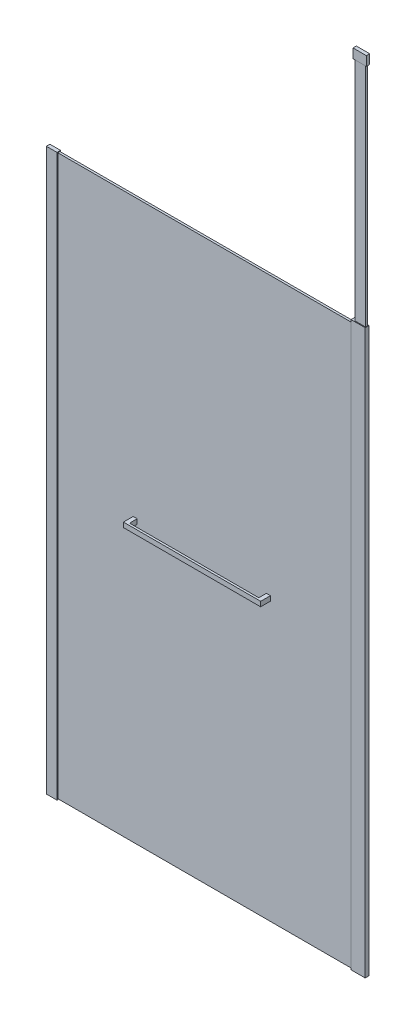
ISO-10303-21;
HEADER;
FILE_DESCRIPTION(('STEP AP214'),'2;1');
FILE_NAME('part.step','',(''),(''),'','','');
FILE_SCHEMA(('AUTOMOTIVE_DESIGN { 1 0 10303 214 1 1 1 1 }'));
ENDSEC;
DATA;
#1=APPLICATION_CONTEXT('core data for automotive mechanical design processes');
#2=APPLICATION_PROTOCOL_DEFINITION('international standard','automotive_design',2000,#1);
#3=PRODUCT_CONTEXT('',#1,'mechanical');
#4=PRODUCT('Part','Part','',(#3));
#5=PRODUCT_RELATED_PRODUCT_CATEGORY('part','',(#4));
#6=PRODUCT_DEFINITION_FORMATION('','',#4);
#7=PRODUCT_DEFINITION_CONTEXT('part definition',#1,'design');
#8=PRODUCT_DEFINITION('design','',#6,#7);
#9=PRODUCT_DEFINITION_SHAPE('','',#8);
#10=(LENGTH_UNIT() NAMED_UNIT(*) SI_UNIT(.MILLI.,.METRE.));
#11=(NAMED_UNIT(*) PLANE_ANGLE_UNIT() SI_UNIT($,.RADIAN.));
#12=(NAMED_UNIT(*) SI_UNIT($,.STERADIAN.) SOLID_ANGLE_UNIT());
#13=UNCERTAINTY_MEASURE_WITH_UNIT(LENGTH_MEASURE(1.E-05),#10,'distance_accuracy_value','');
#14=(GEOMETRIC_REPRESENTATION_CONTEXT(3) GLOBAL_UNCERTAINTY_ASSIGNED_CONTEXT((#13)) GLOBAL_UNIT_ASSIGNED_CONTEXT((#10,
#11,#12)) REPRESENTATION_CONTEXT('',''));
#15=CARTESIAN_POINT('',(0.,0.,0.));
#16=DIRECTION('',(0.,0.,1.));
#17=DIRECTION('',(1.,0.,0.));
#18=AXIS2_PLACEMENT_3D('',#15,#16,#17);
#19=CARTESIAN_POINT('',(337.5,1062.,-21.4));
#20=DIRECTION('',(1.,0.,0.));
#21=DIRECTION('',(0.,0.,-1.));
#22=AXIS2_PLACEMENT_3D('',#19,#20,#21);
#23=PLANE('',#22);
#24=DIRECTION('',(0.,1.,0.));
#25=VECTOR('',#24,1.);
#26=CARTESIAN_POINT('',(337.5,1062.,25.1));
#27=LINE('',#26,#25);
#28=CARTESIAN_POINT('',(337.5,1044.,25.1));
#29=VERTEX_POINT('',#28);
#30=CARTESIAN_POINT('',(337.5,1062.,25.1));
#31=VERTEX_POINT('',#30);
#32=EDGE_CURVE('E63',#29,#31,#27,.T.);
#33=ORIENTED_EDGE('',*,*,#32,.F.);
#34=DIRECTION('',(0.,0.,1.));
#35=VECTOR('',#34,1.);
#36=CARTESIAN_POINT('',(337.5,1044.,-21.4));
#37=LINE('',#36,#35);
#38=CARTESIAN_POINT('',(337.5,1044.,-21.4));
#39=VERTEX_POINT('',#38);
#40=EDGE_CURVE('E12',#39,#29,#37,.T.);
#41=ORIENTED_EDGE('',*,*,#40,.F.);
#42=DIRECTION('',(0.,1.,0.));
#43=VECTOR('',#42,1.);
#44=CARTESIAN_POINT('',(337.5,1062.,-21.4));
#45=LINE('',#44,#43);
#46=CARTESIAN_POINT('',(337.5,1062.,-21.4));
#47=VERTEX_POINT('',#46);
#48=EDGE_CURVE('E193',#39,#47,#45,.T.);
#49=ORIENTED_EDGE('',*,*,#48,.T.);
#50=DIRECTION('',(0.,0.,1.));
#51=VECTOR('',#50,1.);
#52=CARTESIAN_POINT('',(337.5,1062.,-21.4));
#53=LINE('',#52,#51);
#54=EDGE_CURVE('E176',#47,#31,#53,.T.);
#55=ORIENTED_EDGE('',*,*,#54,.T.);
#56=EDGE_LOOP('',(#33,#41,#49,#55));
#57=FACE_BOUND('',#56,.T.);
#58=ADVANCED_FACE('F46',(#57),#23,.T.);
#59=CARTESIAN_POINT('',(322.5,1044.,-21.4));
#60=DIRECTION('',(0.,-1.,0.));
#61=DIRECTION('',(0.,0.,-1.));
#62=AXIS2_PLACEMENT_3D('',#59,#60,#61);
#63=PLANE('',#62);
#64=ORIENTED_EDGE('',*,*,#40,.T.);
#65=DIRECTION('',(-1.,0.,0.));
#66=VECTOR('',#65,1.);
#67=CARTESIAN_POINT('',(842.197715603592,1044.,25.1));
#68=LINE('',#67,#66);
#69=CARTESIAN_POINT('',(822.5,1044.,25.1));
#70=VERTEX_POINT('',#69);
#71=EDGE_CURVE('E166',#70,#29,#68,.T.);
#72=ORIENTED_EDGE('',*,*,#71,.F.);
#73=DIRECTION('',(0.,0.,1.));
#74=VECTOR('',#73,1.);
#75=CARTESIAN_POINT('',(822.5,1044.,-21.4));
#76=LINE('',#75,#74);
#77=CARTESIAN_POINT('',(822.5,1044.,-21.4));
#78=VERTEX_POINT('',#77);
#79=EDGE_CURVE('E149',#78,#70,#76,.T.);
#80=ORIENTED_EDGE('',*,*,#79,.F.);
#81=DIRECTION('',(1.,0.,0.));
#82=VECTOR('',#81,1.);
#83=CARTESIAN_POINT('',(822.5,1044.,-21.4));
#84=LINE('',#83,#82);
#85=CARTESIAN_POINT('',(837.5,1044.,-21.4));
#86=VERTEX_POINT('',#85);
#87=EDGE_CURVE('E131',#78,#86,#84,.T.);
#88=ORIENTED_EDGE('',*,*,#87,.T.);
#89=DIRECTION('',(0.,0.,1.));
#90=VECTOR('',#89,1.);
#91=CARTESIAN_POINT('',(837.5,1044.,-21.4));
#92=LINE('',#91,#90);
#93=CARTESIAN_POINT('',(837.5,1044.,33.1));
#94=VERTEX_POINT('',#93);
#95=EDGE_CURVE('E147',#86,#94,#92,.T.);
#96=ORIENTED_EDGE('',*,*,#95,.T.);
#97=DIRECTION('',(1.,0.,0.));
#98=VECTOR('',#97,1.);
#99=CARTESIAN_POINT('',(322.5,1044.,33.1));
#100=LINE('',#99,#98);
#101=CARTESIAN_POINT('',(322.5,1044.,33.1));
#102=VERTEX_POINT('',#101);
#103=EDGE_CURVE('E135',#102,#94,#100,.T.);
#104=ORIENTED_EDGE('',*,*,#103,.F.);
#105=DIRECTION('',(0.,0.,1.));
#106=VECTOR('',#105,1.);
#107=CARTESIAN_POINT('',(322.5,1044.,-21.4));
#108=LINE('',#107,#106);
#109=CARTESIAN_POINT('',(322.5,1044.,-21.4));
#110=VERTEX_POINT('',#109);
#111=EDGE_CURVE('E55',#110,#102,#108,.T.);
#112=ORIENTED_EDGE('',*,*,#111,.F.);
#113=DIRECTION('',(1.,0.,0.));
#114=VECTOR('',#113,1.);
#115=CARTESIAN_POINT('',(322.5,1044.,-21.4));
#116=LINE('',#115,#114);
#117=EDGE_CURVE('E181',#110,#39,#116,.T.);
#118=ORIENTED_EDGE('',*,*,#117,.T.);
#119=EDGE_LOOP('',(#64,#72,#80,#88,#96,#104,#112,#118));
#120=FACE_BOUND('',#119,.T.);
#121=ADVANCED_FACE('F197',(#120),#63,.T.);
#122=CARTESIAN_POINT('',(322.5,1062.,-21.4));
#123=DIRECTION('',(-1.,0.,0.));
#124=DIRECTION('',(0.,0.,1.));
#125=AXIS2_PLACEMENT_3D('',#122,#123,#124);
#126=PLANE('',#125);
#127=ORIENTED_EDGE('',*,*,#111,.T.);
#128=DIRECTION('',(0.,-1.,0.));
#129=VECTOR('',#128,1.);
#130=CARTESIAN_POINT('',(322.5,1062.,33.1));
#131=LINE('',#130,#129);
#132=CARTESIAN_POINT('',(322.5,1062.,33.1));
#133=VERTEX_POINT('',#132);
#134=EDGE_CURVE('E121',#133,#102,#131,.T.);
#135=ORIENTED_EDGE('',*,*,#134,.F.);
#136=DIRECTION('',(0.,0.,1.));
#137=VECTOR('',#136,1.);
#138=CARTESIAN_POINT('',(322.5,1062.,-21.4));
#139=LINE('',#138,#137);
#140=CARTESIAN_POINT('',(322.5,1062.,-21.4));
#141=VERTEX_POINT('',#140);
#142=EDGE_CURVE('E116',#141,#133,#139,.T.);
#143=ORIENTED_EDGE('',*,*,#142,.F.);
#144=DIRECTION('',(0.,-1.,0.));
#145=VECTOR('',#144,1.);
#146=CARTESIAN_POINT('',(322.5,1062.,-21.4));
#147=LINE('',#146,#145);
#148=EDGE_CURVE('E186',#141,#110,#147,.T.);
#149=ORIENTED_EDGE('',*,*,#148,.T.);
#150=EDGE_LOOP('',(#127,#135,#143,#149));
#151=FACE_BOUND('',#150,.T.);
#152=ADVANCED_FACE('F218',(#151),#126,.T.);
#153=CARTESIAN_POINT('',(322.5,1062.,-21.4));
#154=DIRECTION('',(0.,1.,0.));
#155=DIRECTION('',(0.,0.,1.));
#156=AXIS2_PLACEMENT_3D('',#153,#154,#155);
#157=PLANE('',#156);
#158=ORIENTED_EDGE('',*,*,#142,.T.);
#159=DIRECTION('',(-1.,0.,0.));
#160=VECTOR('',#159,1.);
#161=CARTESIAN_POINT('',(322.5,1062.,33.1));
#162=LINE('',#161,#160);
#163=CARTESIAN_POINT('',(837.5,1062.,33.1));
#164=VERTEX_POINT('',#163);
#165=EDGE_CURVE('E109',#164,#133,#162,.T.);
#166=ORIENTED_EDGE('',*,*,#165,.F.);
#167=DIRECTION('',(0.,0.,1.));
#168=VECTOR('',#167,1.);
#169=CARTESIAN_POINT('',(837.5,1062.,-21.4));
#170=LINE('',#169,#168);
#171=CARTESIAN_POINT('',(837.5,1062.,-21.4));
#172=VERTEX_POINT('',#171);
#173=EDGE_CURVE('E113',#172,#164,#170,.T.);
#174=ORIENTED_EDGE('',*,*,#173,.F.);
#175=DIRECTION('',(-1.,0.,0.));
#176=VECTOR('',#175,1.);
#177=CARTESIAN_POINT('',(822.5,1062.,-21.4));
#178=LINE('',#177,#176);
#179=CARTESIAN_POINT('',(822.5,1062.,-21.4));
#180=VERTEX_POINT('',#179);
#181=EDGE_CURVE('E138',#172,#180,#178,.T.);
#182=ORIENTED_EDGE('',*,*,#181,.T.);
#183=DIRECTION('',(0.,0.,1.));
#184=VECTOR('',#183,1.);
#185=CARTESIAN_POINT('',(822.5,1062.,-21.4));
#186=LINE('',#185,#184);
#187=CARTESIAN_POINT('',(822.5,1062.,25.1));
#188=VERTEX_POINT('',#187);
#189=EDGE_CURVE('E130',#180,#188,#186,.T.);
#190=ORIENTED_EDGE('',*,*,#189,.T.);
#191=DIRECTION('',(-1.,0.,0.));
#192=VECTOR('',#191,1.);
#193=CARTESIAN_POINT('',(842.197715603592,1062.,25.1));
#194=LINE('',#193,#192);
#195=EDGE_CURVE('E163',#188,#31,#194,.T.);
#196=ORIENTED_EDGE('',*,*,#195,.T.);
#197=ORIENTED_EDGE('',*,*,#54,.F.);
#198=DIRECTION('',(-1.,0.,0.));
#199=VECTOR('',#198,1.);
#200=CARTESIAN_POINT('',(322.5,1062.,-21.4));
#201=LINE('',#200,#199);
#202=EDGE_CURVE('E190',#47,#141,#201,.T.);
#203=ORIENTED_EDGE('',*,*,#202,.T.);
#204=EDGE_LOOP('',(#158,#166,#174,#182,#190,#196,#197,#203));
#205=FACE_BOUND('',#204,.T.);
#206=ADVANCED_FACE('F111',(#205),#157,.T.);
#207=CARTESIAN_POINT('',(337.5,1044.,-21.4));
#208=DIRECTION('',(0.,0.,1.));
#209=DIRECTION('',(1.,0.,0.));
#210=AXIS2_PLACEMENT_3D('',#207,#208,#209);
#211=PLANE('',#210);
#212=ORIENTED_EDGE('',*,*,#48,.F.);
#213=ORIENTED_EDGE('',*,*,#117,.F.);
#214=ORIENTED_EDGE('',*,*,#148,.F.);
#215=ORIENTED_EDGE('',*,*,#202,.F.);
#216=EDGE_LOOP('',(#212,#213,#214,#215));
#217=FACE_BOUND('',#216,.T.);
#218=ADVANCED_FACE('F225',(#217),#211,.F.);
#219=CARTESIAN_POINT('',(337.5,1044.,33.1));
#220=DIRECTION('',(0.,0.,1.));
#221=DIRECTION('',(1.,0.,0.));
#222=AXIS2_PLACEMENT_3D('',#219,#220,#221);
#223=PLANE('',#222);
#224=ORIENTED_EDGE('',*,*,#103,.T.);
#225=DIRECTION('',(0.,1.,0.));
#226=VECTOR('',#225,1.);
#227=CARTESIAN_POINT('',(837.5,1062.,33.1));
#228=LINE('',#227,#226);
#229=EDGE_CURVE('E127',#94,#164,#228,.T.);
#230=ORIENTED_EDGE('',*,*,#229,.T.);
#231=ORIENTED_EDGE('',*,*,#165,.T.);
#232=ORIENTED_EDGE('',*,*,#134,.T.);
#233=EDGE_LOOP('',(#224,#230,#231,#232));
#234=FACE_BOUND('',#233,.T.);
#235=ADVANCED_FACE('F133',(#234),#223,.T.);
#236=CARTESIAN_POINT('',(842.197715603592,1062.,25.1));
#237=DIRECTION('',(0.,0.,1.));
#238=DIRECTION('',(1.,0.,0.));
#239=AXIS2_PLACEMENT_3D('',#236,#237,#238);
#240=PLANE('',#239);
#241=ORIENTED_EDGE('',*,*,#195,.F.);
#242=DIRECTION('',(0.,-1.,0.));
#243=VECTOR('',#242,1.);
#244=CARTESIAN_POINT('',(822.5,1062.,25.1));
#245=LINE('',#244,#243);
#246=EDGE_CURVE('E49',#188,#70,#245,.T.);
#247=ORIENTED_EDGE('',*,*,#246,.T.);
#248=ORIENTED_EDGE('',*,*,#71,.T.);
#249=ORIENTED_EDGE('',*,*,#32,.T.);
#250=EDGE_LOOP('',(#241,#247,#248,#249));
#251=FACE_BOUND('',#250,.T.);
#252=ADVANCED_FACE('F203',(#251),#240,.F.);
#253=CARTESIAN_POINT('',(822.5,1062.,-21.4));
#254=DIRECTION('',(-1.,0.,0.));
#255=DIRECTION('',(0.,0.,1.));
#256=AXIS2_PLACEMENT_3D('',#253,#254,#255);
#257=PLANE('',#256);
#258=ORIENTED_EDGE('',*,*,#246,.F.);
#259=ORIENTED_EDGE('',*,*,#189,.F.);
#260=DIRECTION('',(0.,-1.,0.));
#261=VECTOR('',#260,1.);
#262=CARTESIAN_POINT('',(822.5,1062.,-21.4));
#263=LINE('',#262,#261);
#264=EDGE_CURVE('E142',#180,#78,#263,.T.);
#265=ORIENTED_EDGE('',*,*,#264,.T.);
#266=ORIENTED_EDGE('',*,*,#79,.T.);
#267=EDGE_LOOP('',(#258,#259,#265,#266));
#268=FACE_BOUND('',#267,.T.);
#269=ADVANCED_FACE('F204',(#268),#257,.T.);
#270=CARTESIAN_POINT('',(837.5,1062.,-21.4));
#271=DIRECTION('',(1.,0.,0.));
#272=DIRECTION('',(0.,0.,-1.));
#273=AXIS2_PLACEMENT_3D('',#270,#271,#272);
#274=PLANE('',#273);
#275=ORIENTED_EDGE('',*,*,#173,.T.);
#276=ORIENTED_EDGE('',*,*,#229,.F.);
#277=ORIENTED_EDGE('',*,*,#95,.F.);
#278=DIRECTION('',(0.,1.,0.));
#279=VECTOR('',#278,1.);
#280=CARTESIAN_POINT('',(837.5,1062.,-21.4));
#281=LINE('',#280,#279);
#282=EDGE_CURVE('E129',#86,#172,#281,.T.);
#283=ORIENTED_EDGE('',*,*,#282,.T.);
#284=EDGE_LOOP('',(#275,#276,#277,#283));
#285=FACE_BOUND('',#284,.T.);
#286=ADVANCED_FACE('F126',(#285),#274,.T.);
#287=CARTESIAN_POINT('',(837.5,1044.,-21.4));
#288=DIRECTION('',(0.,0.,1.));
#289=DIRECTION('',(1.,0.,0.));
#290=AXIS2_PLACEMENT_3D('',#287,#288,#289);
#291=PLANE('',#290);
#292=ORIENTED_EDGE('',*,*,#282,.F.);
#293=ORIENTED_EDGE('',*,*,#87,.F.);
#294=ORIENTED_EDGE('',*,*,#264,.F.);
#295=ORIENTED_EDGE('',*,*,#181,.F.);
#296=EDGE_LOOP('',(#292,#293,#294,#295));
#297=FACE_BOUND('',#296,.T.);
#298=ADVANCED_FACE('F200',(#297),#291,.F.);
#299=CLOSED_SHELL('',(#58,#121,#152,#206,#218,#235,#252,#269,#286,#298));
#300=MANIFOLD_SOLID_BREP('B2',#299);
#301=CARTESIAN_POINT('',(1149.9,3000.,-1.1500000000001));
#302=DIRECTION('',(1.,0.,0.));
#303=DIRECTION('',(0.,1.,0.));
#304=AXIS2_PLACEMENT_3D('',#301,#302,#303);
#305=PLANE('',#304);
#306=DIRECTION('',(0.,0.,1.));
#307=VECTOR('',#306,1.);
#308=CARTESIAN_POINT('',(1149.9,2965.,-1.1500000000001));
#309=LINE('',#308,#307);
#310=CARTESIAN_POINT('',(1149.9,2965.,-13.6500000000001));
#311=VERTEX_POINT('',#310);
#312=CARTESIAN_POINT('',(1149.9,2965.,-1.1500000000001));
#313=VERTEX_POINT('',#312);
#314=EDGE_CURVE('E406',#311,#313,#309,.T.);
#315=ORIENTED_EDGE('',*,*,#314,.T.);
#316=DIRECTION('',(0.,-1.,0.));
#317=VECTOR('',#316,1.);
#318=CARTESIAN_POINT('',(1149.9,3000.,-1.1500000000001));
#319=LINE('',#318,#317);
#320=CARTESIAN_POINT('',(1149.9,3000.,-1.1500000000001));
#321=VERTEX_POINT('',#320);
#322=EDGE_CURVE('E387',#321,#313,#319,.T.);
#323=ORIENTED_EDGE('',*,*,#322,.F.);
#324=DIRECTION('',(0.,0.,1.));
#325=VECTOR('',#324,1.);
#326=CARTESIAN_POINT('',(1149.9,3000.,-1.1500000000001));
#327=LINE('',#326,#325);
#328=CARTESIAN_POINT('',(1149.9,3000.,-13.6500000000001));
#329=VERTEX_POINT('',#328);
#330=EDGE_CURVE('E394',#329,#321,#327,.T.);
#331=ORIENTED_EDGE('',*,*,#330,.F.);
#332=DIRECTION('',(0.,-1.,0.));
#333=VECTOR('',#332,1.);
#334=CARTESIAN_POINT('',(1149.9,3000.,-13.6500000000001));
#335=LINE('',#334,#333);
#336=EDGE_CURVE('E545',#329,#311,#335,.T.);
#337=ORIENTED_EDGE('',*,*,#336,.T.);
#338=EDGE_LOOP('',(#315,#323,#331,#337));
#339=FACE_BOUND('',#338,.T.);
#340=ADVANCED_FACE('F318',(#339),#305,.F.);
#341=CARTESIAN_POINT('',(1199.9,3000.,-1.1500000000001));
#342=DIRECTION('',(0.,0.,-1.));
#343=DIRECTION('',(-1.,0.,0.));
#344=AXIS2_PLACEMENT_3D('',#341,#342,#343);
#345=PLANE('',#344);
#346=DIRECTION('',(1.,0.,0.));
#347=VECTOR('',#346,1.);
#348=CARTESIAN_POINT('',(1199.9,2965.,-1.1500000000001));
#349=LINE('',#348,#347);
#350=CARTESIAN_POINT('',(1199.9,2965.,-1.1500000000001));
#351=VERTEX_POINT('',#350);
#352=EDGE_CURVE('E543',#313,#351,#349,.T.);
#353=ORIENTED_EDGE('',*,*,#352,.T.);
#354=DIRECTION('',(0.,-1.,0.));
#355=VECTOR('',#354,1.);
#356=CARTESIAN_POINT('',(1199.9,3000.,-1.1500000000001));
#357=LINE('',#356,#355);
#358=CARTESIAN_POINT('',(1199.9,3000.,-1.1500000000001));
#359=VERTEX_POINT('',#358);
#360=EDGE_CURVE('E390',#359,#351,#357,.T.);
#361=ORIENTED_EDGE('',*,*,#360,.F.);
#362=DIRECTION('',(1.,0.,0.));
#363=VECTOR('',#362,1.);
#364=CARTESIAN_POINT('',(1199.9,3000.,-1.1500000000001));
#365=LINE('',#364,#363);
#366=EDGE_CURVE('E383',#321,#359,#365,.T.);
#367=ORIENTED_EDGE('',*,*,#366,.F.);
#368=ORIENTED_EDGE('',*,*,#322,.T.);
#369=EDGE_LOOP('',(#353,#361,#367,#368));
#370=FACE_BOUND('',#369,.T.);
#371=ADVANCED_FACE('F385',(#370),#345,.F.);
#372=CARTESIAN_POINT('',(1199.9,3000.,-1.1500000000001));
#373=DIRECTION('',(-1.,0.,0.));
#374=DIRECTION('',(0.,-1.,0.));
#375=AXIS2_PLACEMENT_3D('',#372,#373,#374);
#376=PLANE('',#375);
#377=DIRECTION('',(0.,0.,-1.));
#378=VECTOR('',#377,1.);
#379=CARTESIAN_POINT('',(1199.9,2965.,-1.1500000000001));
#380=LINE('',#379,#378);
#381=CARTESIAN_POINT('',(1199.9,2965.,-13.6500000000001));
#382=VERTEX_POINT('',#381);
#383=EDGE_CURVE('E539',#351,#382,#380,.T.);
#384=ORIENTED_EDGE('',*,*,#383,.T.);
#385=DIRECTION('',(0.,-1.,0.));
#386=VECTOR('',#385,1.);
#387=CARTESIAN_POINT('',(1199.9,3000.,-13.6500000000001));
#388=LINE('',#387,#386);
#389=CARTESIAN_POINT('',(1199.9,3000.,-13.6500000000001));
#390=VERTEX_POINT('',#389);
#391=EDGE_CURVE('E410',#390,#382,#388,.T.);
#392=ORIENTED_EDGE('',*,*,#391,.F.);
#393=DIRECTION('',(0.,0.,-1.));
#394=VECTOR('',#393,1.);
#395=CARTESIAN_POINT('',(1199.9,3000.,-1.1500000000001));
#396=LINE('',#395,#394);
#397=EDGE_CURVE('E393',#359,#390,#396,.T.);
#398=ORIENTED_EDGE('',*,*,#397,.F.);
#399=ORIENTED_EDGE('',*,*,#360,.T.);
#400=EDGE_LOOP('',(#384,#392,#398,#399));
#401=FACE_BOUND('',#400,.T.);
#402=ADVANCED_FACE('F460',(#401),#376,.F.);
#403=CARTESIAN_POINT('',(1199.9,3000.,-13.6500000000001));
#404=DIRECTION('',(0.,0.,1.));
#405=DIRECTION('',(1.,0.,0.));
#406=AXIS2_PLACEMENT_3D('',#403,#404,#405);
#407=PLANE('',#406);
#408=DIRECTION('',(-1.,0.,0.));
#409=VECTOR('',#408,1.);
#410=CARTESIAN_POINT('',(1199.9,2965.,-13.6500000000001));
#411=LINE('',#410,#409);
#412=EDGE_CURVE('E403',#382,#311,#411,.T.);
#413=ORIENTED_EDGE('',*,*,#412,.T.);
#414=ORIENTED_EDGE('',*,*,#336,.F.);
#415=DIRECTION('',(-1.,0.,0.));
#416=VECTOR('',#415,1.);
#417=CARTESIAN_POINT('',(1199.9,3000.,-13.6500000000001));
#418=LINE('',#417,#416);
#419=EDGE_CURVE('E399',#390,#329,#418,.T.);
#420=ORIENTED_EDGE('',*,*,#419,.F.);
#421=ORIENTED_EDGE('',*,*,#391,.T.);
#422=EDGE_LOOP('',(#413,#414,#420,#421));
#423=FACE_BOUND('',#422,.T.);
#424=ADVANCED_FACE('F507',(#423),#407,.F.);
#425=CARTESIAN_POINT('',(1149.9,3000.,-13.6500000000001));
#426=DIRECTION('',(0.,1.,0.));
#427=DIRECTION('',(0.,0.,1.));
#428=AXIS2_PLACEMENT_3D('',#425,#426,#427);
#429=PLANE('',#428);
#430=ORIENTED_EDGE('',*,*,#330,.T.);
#431=ORIENTED_EDGE('',*,*,#366,.T.);
#432=ORIENTED_EDGE('',*,*,#397,.T.);
#433=ORIENTED_EDGE('',*,*,#419,.T.);
#434=EDGE_LOOP('',(#430,#431,#432,#433));
#435=FACE_BOUND('',#434,.T.);
#436=ADVANCED_FACE('F397',(#435),#429,.T.);
#437=CARTESIAN_POINT('',(1149.9,2965.,-13.6500000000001));
#438=DIRECTION('',(0.,1.,0.));
#439=DIRECTION('',(0.,0.,1.));
#440=AXIS2_PLACEMENT_3D('',#437,#438,#439);
#441=PLANE('',#440);
#442=DIRECTION('',(0.,0.,1.));
#443=VECTOR('',#442,1.);
#444=CARTESIAN_POINT('',(1194.9,2965.,-11.4000000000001));
#445=LINE('',#444,#443);
#446=CARTESIAN_POINT('',(1194.9,2965.,-11.4000000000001));
#447=VERTEX_POINT('',#446);
#448=CARTESIAN_POINT('',(1194.9,2965.,-3.40000000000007));
#449=VERTEX_POINT('',#448);
#450=EDGE_CURVE('E415',#447,#449,#445,.T.);
#451=ORIENTED_EDGE('',*,*,#450,.F.);
#452=DIRECTION('',(1.,0.,0.));
#453=VECTOR('',#452,1.);
#454=CARTESIAN_POINT('',(1194.9,2965.,-11.4000000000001));
#455=LINE('',#454,#453);
#456=CARTESIAN_POINT('',(1154.9,2965.,-11.4000000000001));
#457=VERTEX_POINT('',#456);
#458=EDGE_CURVE('E408',#457,#447,#455,.T.);
#459=ORIENTED_EDGE('',*,*,#458,.F.);
#460=DIRECTION('',(0.,0.,-1.));
#461=VECTOR('',#460,1.);
#462=CARTESIAN_POINT('',(1154.9,2965.,-11.4000000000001));
#463=LINE('',#462,#461);
#464=CARTESIAN_POINT('',(1154.9,2965.,-3.40000000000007));
#465=VERTEX_POINT('',#464);
#466=EDGE_CURVE('E333',#465,#457,#463,.T.);
#467=ORIENTED_EDGE('',*,*,#466,.F.);
#468=DIRECTION('',(-1.,0.,0.));
#469=VECTOR('',#468,1.);
#470=CARTESIAN_POINT('',(1194.9,2965.,-3.40000000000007));
#471=LINE('',#470,#469);
#472=EDGE_CURVE('E44',#449,#465,#471,.T.);
#473=ORIENTED_EDGE('',*,*,#472,.F.);
#474=EDGE_LOOP('',(#451,#459,#467,#473));
#475=FACE_BOUND('',#474,.T.);
#476=ORIENTED_EDGE('',*,*,#314,.F.);
#477=ORIENTED_EDGE('',*,*,#412,.F.);
#478=ORIENTED_EDGE('',*,*,#383,.F.);
#479=ORIENTED_EDGE('',*,*,#352,.F.);
#480=EDGE_LOOP('',(#476,#477,#478,#479));
#481=FACE_BOUND('',#480,.T.);
#482=ADVANCED_FACE('F490',(#475,#481),#441,.F.);
#483=CARTESIAN_POINT('',(1194.9,2997.,-11.4000000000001));
#484=DIRECTION('',(1.,0.,0.));
#485=DIRECTION('',(0.,0.,-1.));
#486=AXIS2_PLACEMENT_3D('',#483,#484,#485);
#487=PLANE('',#486);
#488=DIRECTION('',(0.,-1.,0.));
#489=VECTOR('',#488,1.);
#490=CARTESIAN_POINT('',(1194.9,2997.,-11.4000000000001));
#491=LINE('',#490,#489);
#492=CARTESIAN_POINT('',(1194.9,2114.,-11.4000000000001));
#493=VERTEX_POINT('',#492);
#494=EDGE_CURVE('E326',#447,#493,#491,.T.);
#495=ORIENTED_EDGE('',*,*,#494,.F.);
#496=ORIENTED_EDGE('',*,*,#450,.T.);
#497=DIRECTION('',(0.,-1.,0.));
#498=VECTOR('',#497,1.);
#499=CARTESIAN_POINT('',(1194.9,2997.,-3.40000000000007));
#500=LINE('',#499,#498);
#501=CARTESIAN_POINT('',(1194.9,2114.,-3.40000000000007));
#502=VERTEX_POINT('',#501);
#503=EDGE_CURVE('E430',#449,#502,#500,.T.);
#504=ORIENTED_EDGE('',*,*,#503,.T.);
#505=DIRECTION('',(0.,0.,1.));
#506=VECTOR('',#505,1.);
#507=CARTESIAN_POINT('',(1194.9,2114.,-11.4000000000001));
#508=LINE('',#507,#506);
#509=EDGE_CURVE('E418',#493,#502,#508,.T.);
#510=ORIENTED_EDGE('',*,*,#509,.F.);
#511=EDGE_LOOP('',(#495,#496,#504,#510));
#512=FACE_BOUND('',#511,.T.);
#513=ADVANCED_FACE('F320',(#512),#487,.T.);
#514=CARTESIAN_POINT('',(1194.9,2997.,-11.4000000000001));
#515=DIRECTION('',(0.,0.,-1.));
#516=DIRECTION('',(-1.,0.,0.));
#517=AXIS2_PLACEMENT_3D('',#514,#515,#516);
#518=PLANE('',#517);
#519=DIRECTION('',(0.,-1.,0.));
#520=VECTOR('',#519,1.);
#521=CARTESIAN_POINT('',(1154.9,2997.,-11.4000000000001));
#522=LINE('',#521,#520);
#523=CARTESIAN_POINT('',(1154.9,2114.,-11.4000000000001));
#524=VERTEX_POINT('',#523);
#525=EDGE_CURVE('E432',#457,#524,#522,.T.);
#526=ORIENTED_EDGE('',*,*,#525,.F.);
#527=ORIENTED_EDGE('',*,*,#458,.T.);
#528=ORIENTED_EDGE('',*,*,#494,.T.);
#529=DIRECTION('',(1.,0.,0.));
#530=VECTOR('',#529,1.);
#531=CARTESIAN_POINT('',(1194.9,2114.,-11.4000000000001));
#532=LINE('',#531,#530);
#533=EDGE_CURVE('E427',#524,#493,#532,.T.);
#534=ORIENTED_EDGE('',*,*,#533,.F.);
#535=EDGE_LOOP('',(#526,#527,#528,#534));
#536=FACE_BOUND('',#535,.T.);
#537=ADVANCED_FACE('F445',(#536),#518,.T.);
#538=CARTESIAN_POINT('',(1154.9,2997.,-11.4000000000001));
#539=DIRECTION('',(-1.,0.,0.));
#540=DIRECTION('',(0.,0.,1.));
#541=AXIS2_PLACEMENT_3D('',#538,#539,#540);
#542=PLANE('',#541);
#543=DIRECTION('',(0.,-1.,0.));
#544=VECTOR('',#543,1.);
#545=CARTESIAN_POINT('',(1154.9,2997.,-3.40000000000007));
#546=LINE('',#545,#544);
#547=CARTESIAN_POINT('',(1154.9,2114.,-3.40000000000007));
#548=VERTEX_POINT('',#547);
#549=EDGE_CURVE('E434',#465,#548,#546,.T.);
#550=ORIENTED_EDGE('',*,*,#549,.F.);
#551=ORIENTED_EDGE('',*,*,#466,.T.);
#552=ORIENTED_EDGE('',*,*,#525,.T.);
#553=DIRECTION('',(0.,0.,-1.));
#554=VECTOR('',#553,1.);
#555=CARTESIAN_POINT('',(1154.9,2114.,-11.4000000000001));
#556=LINE('',#555,#554);
#557=EDGE_CURVE('E424',#548,#524,#556,.T.);
#558=ORIENTED_EDGE('',*,*,#557,.F.);
#559=EDGE_LOOP('',(#550,#551,#552,#558));
#560=FACE_BOUND('',#559,.T.);
#561=ADVANCED_FACE('F447',(#560),#542,.T.);
#562=CARTESIAN_POINT('',(1194.9,2997.,-3.40000000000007));
#563=DIRECTION('',(0.,0.,1.));
#564=DIRECTION('',(1.,0.,0.));
#565=AXIS2_PLACEMENT_3D('',#562,#563,#564);
#566=PLANE('',#565);
#567=ORIENTED_EDGE('',*,*,#503,.F.);
#568=ORIENTED_EDGE('',*,*,#472,.T.);
#569=ORIENTED_EDGE('',*,*,#549,.T.);
#570=DIRECTION('',(-1.,0.,0.));
#571=VECTOR('',#570,1.);
#572=CARTESIAN_POINT('',(1194.9,2114.,-3.40000000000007));
#573=LINE('',#572,#571);
#574=EDGE_CURVE('E421',#502,#548,#573,.T.);
#575=ORIENTED_EDGE('',*,*,#574,.F.);
#576=EDGE_LOOP('',(#567,#568,#569,#575));
#577=FACE_BOUND('',#576,.T.);
#578=ADVANCED_FACE('F439',(#577),#566,.T.);
#579=CARTESIAN_POINT('',(1194.9,2114.,-3.40000000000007));
#580=DIRECTION('',(0.,-1.,0.));
#581=DIRECTION('',(0.,0.,-1.));
#582=AXIS2_PLACEMENT_3D('',#579,#580,#581);
#583=PLANE('',#582);
#584=ORIENTED_EDGE('',*,*,#509,.T.);
#585=ORIENTED_EDGE('',*,*,#574,.T.);
#586=ORIENTED_EDGE('',*,*,#557,.T.);
#587=ORIENTED_EDGE('',*,*,#533,.T.);
#588=EDGE_LOOP('',(#584,#585,#586,#587));
#589=FACE_BOUND('',#588,.T.);
#590=ADVANCED_FACE('F443',(#589),#583,.T.);
#591=CLOSED_SHELL('',(#340,#371,#402,#424,#436,#482,#513,#537,#561,#578,#590));
#592=MANIFOLD_SOLID_BREP('B6',#591);
#593=CARTESIAN_POINT('',(1153.5,2111.,-3.39999999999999));
#594=DIRECTION('',(0.,0.,-1.));
#595=DIRECTION('',(-1.,0.,0.));
#596=AXIS2_PLACEMENT_3D('',#593,#594,#595);
#597=PLANE('',#596);
#598=DIRECTION('',(-1.,0.,0.));
#599=VECTOR('',#598,1.);
#600=CARTESIAN_POINT('',(1153.5,2103.2,-3.39999999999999));
#601=LINE('',#600,#599);
#602=CARTESIAN_POINT('',(1153.5,2103.2,-3.39999999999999));
#603=VERTEX_POINT('',#602);
#604=CARTESIAN_POINT('',(1143.4,2103.2,-3.39999999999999));
#605=VERTEX_POINT('',#604);
#606=EDGE_CURVE('E672',#603,#605,#601,.T.);
#607=ORIENTED_EDGE('',*,*,#606,.F.);
#608=DIRECTION('',(0.,-1.,0.));
#609=VECTOR('',#608,1.);
#610=CARTESIAN_POINT('',(1153.5,2111.,-3.39999999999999));
#611=LINE('',#610,#609);
#612=CARTESIAN_POINT('',(1153.5,3.,-3.39999999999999));
#613=VERTEX_POINT('',#612);
#614=EDGE_CURVE('E695',#603,#613,#611,.T.);
#615=ORIENTED_EDGE('',*,*,#614,.T.);
#616=DIRECTION('',(1.,0.,0.));
#617=VECTOR('',#616,1.);
#618=CARTESIAN_POINT('',(1153.5,3.,-3.39999999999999));
#619=LINE('',#618,#617);
#620=CARTESIAN_POINT('',(1143.4,3.,-3.39999999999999));
#621=VERTEX_POINT('',#620);
#622=EDGE_CURVE('E683',#621,#613,#619,.T.);
#623=ORIENTED_EDGE('',*,*,#622,.F.);
#624=DIRECTION('',(0.,-1.,0.));
#625=VECTOR('',#624,1.);
#626=CARTESIAN_POINT('',(1143.4,2111.,-3.39999999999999));
#627=LINE('',#626,#625);
#628=EDGE_CURVE('E575',#605,#621,#627,.T.);
#629=ORIENTED_EDGE('',*,*,#628,.F.);
#630=EDGE_LOOP('',(#607,#615,#623,#629));
#631=FACE_BOUND('',#630,.T.);
#632=ADVANCED_FACE('F567',(#631),#597,.T.);
#633=CARTESIAN_POINT('',(1143.4,2111.,-3.39999999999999));
#634=DIRECTION('',(-1.,0.,0.));
#635=DIRECTION('',(0.,0.,1.));
#636=AXIS2_PLACEMENT_3D('',#633,#634,#635);
#637=PLANE('',#636);
#638=DIRECTION('',(0.,-1.,0.));
#639=VECTOR('',#638,1.);
#640=CARTESIAN_POINT('',(1143.4,2111.,-14.4));
#641=LINE('',#640,#639);
#642=CARTESIAN_POINT('',(1143.4,2114.,-14.4));
#643=VERTEX_POINT('',#642);
#644=CARTESIAN_POINT('',(1143.4,0.,-14.4));
#645=VERTEX_POINT('',#644);
#646=EDGE_CURVE('E635',#643,#645,#641,.T.);
#647=ORIENTED_EDGE('',*,*,#646,.T.);
#648=DIRECTION('',(0.,0.,-1.));
#649=VECTOR('',#648,1.);
#650=CARTESIAN_POINT('',(1143.4,0.,-0.399999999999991));
#651=LINE('',#650,#649);
#652=CARTESIAN_POINT('',(1143.4,0.,-0.399999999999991));
#653=VERTEX_POINT('',#652);
#654=EDGE_CURVE('E639',#653,#645,#651,.T.);
#655=ORIENTED_EDGE('',*,*,#654,.F.);
#656=DIRECTION('',(0.,-1.,0.));
#657=VECTOR('',#656,1.);
#658=CARTESIAN_POINT('',(1143.4,2111.,-0.399999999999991));
#659=LINE('',#658,#657);
#660=CARTESIAN_POINT('',(1143.4,2114.,-0.399999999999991));
#661=VERTEX_POINT('',#660);
#662=EDGE_CURVE('E690',#661,#653,#659,.T.);
#663=ORIENTED_EDGE('',*,*,#662,.F.);
#664=DIRECTION('',(0.,0.,1.));
#665=VECTOR('',#664,1.);
#666=CARTESIAN_POINT('',(1143.4,2114.,-14.4));
#667=LINE('',#666,#665);
#668=EDGE_CURVE('E641',#643,#661,#667,.T.);
#669=ORIENTED_EDGE('',*,*,#668,.F.);
#670=EDGE_LOOP('',(#647,#655,#663,#669));
#671=FACE_BOUND('',#670,.T.);
#672=DIRECTION('',(0.,0.,1.));
#673=VECTOR('',#672,1.);
#674=CARTESIAN_POINT('',(1143.4,2103.2,-3.34999999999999));
#675=LINE('',#674,#673);
#676=CARTESIAN_POINT('',(1143.4,2103.2,-11.4));
#677=VERTEX_POINT('',#676);
#678=EDGE_CURVE('E666',#677,#605,#675,.T.);
#679=ORIENTED_EDGE('',*,*,#678,.T.);
#680=ORIENTED_EDGE('',*,*,#628,.T.);
#681=DIRECTION('',(0.,0.,-1.));
#682=VECTOR('',#681,1.);
#683=CARTESIAN_POINT('',(1143.4,3.,-0.399999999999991));
#684=LINE('',#683,#682);
#685=CARTESIAN_POINT('',(1143.4,3.,-11.4));
#686=VERTEX_POINT('',#685);
#687=EDGE_CURVE('E660',#621,#686,#684,.T.);
#688=ORIENTED_EDGE('',*,*,#687,.T.);
#689=DIRECTION('',(0.,-1.,0.));
#690=VECTOR('',#689,1.);
#691=CARTESIAN_POINT('',(1143.4,2111.,-11.4));
#692=LINE('',#691,#690);
#693=EDGE_CURVE('E646',#677,#686,#692,.T.);
#694=ORIENTED_EDGE('',*,*,#693,.F.);
#695=EDGE_LOOP('',(#679,#680,#688,#694));
#696=FACE_BOUND('',#695,.T.);
#697=ADVANCED_FACE('F637',(#671,#696),#637,.T.);
#698=CARTESIAN_POINT('',(1143.4,2111.,-0.399999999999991));
#699=DIRECTION('',(0.,0.,1.));
#700=DIRECTION('',(1.,0.,0.));
#701=AXIS2_PLACEMENT_3D('',#698,#699,#700);
#702=PLANE('',#701);
#703=ORIENTED_EDGE('',*,*,#662,.T.);
#704=DIRECTION('',(-1.,0.,0.));
#705=VECTOR('',#704,1.);
#706=CARTESIAN_POINT('',(1143.4,0.,-0.399999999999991));
#707=LINE('',#706,#705);
#708=CARTESIAN_POINT('',(1196.4,0.,-0.399999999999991));
#709=VERTEX_POINT('',#708);
#710=EDGE_CURVE('E659',#709,#653,#707,.T.);
#711=ORIENTED_EDGE('',*,*,#710,.F.);
#712=DIRECTION('',(0.,-1.,0.));
#713=VECTOR('',#712,1.);
#714=CARTESIAN_POINT('',(1196.4,2111.,-0.399999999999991));
#715=LINE('',#714,#713);
#716=CARTESIAN_POINT('',(1196.4,2114.,-0.399999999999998));
#717=VERTEX_POINT('',#716);
#718=EDGE_CURVE('E782',#717,#709,#715,.T.);
#719=ORIENTED_EDGE('',*,*,#718,.F.);
#720=DIRECTION('',(1.,0.,0.));
#721=VECTOR('',#720,1.);
#722=CARTESIAN_POINT('',(1196.4,2114.,-0.399999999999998));
#723=LINE('',#722,#721);
#724=EDGE_CURVE('E680',#661,#717,#723,.T.);
#725=ORIENTED_EDGE('',*,*,#724,.F.);
#726=EDGE_LOOP('',(#703,#711,#719,#725));
#727=FACE_BOUND('',#726,.T.);
#728=ADVANCED_FACE('F723',(#727),#702,.T.);
#729=CARTESIAN_POINT('',(1196.4,2111.,-0.399999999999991));
#730=DIRECTION('',(1.,0.,0.));
#731=DIRECTION('',(0.,0.,-1.));
#732=AXIS2_PLACEMENT_3D('',#729,#730,#731);
#733=PLANE('',#732);
#734=ORIENTED_EDGE('',*,*,#718,.T.);
#735=DIRECTION('',(0.,0.,1.));
#736=VECTOR('',#735,1.);
#737=CARTESIAN_POINT('',(1196.4,0.,-0.399999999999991));
#738=LINE('',#737,#736);
#739=CARTESIAN_POINT('',(1196.4,0.,-14.4));
#740=VERTEX_POINT('',#739);
#741=EDGE_CURVE('E654',#740,#709,#738,.T.);
#742=ORIENTED_EDGE('',*,*,#741,.F.);
#743=DIRECTION('',(0.,-1.,0.));
#744=VECTOR('',#743,1.);
#745=CARTESIAN_POINT('',(1196.4,2111.,-14.4));
#746=LINE('',#745,#744);
#747=CARTESIAN_POINT('',(1196.4,2114.,-14.4));
#748=VERTEX_POINT('',#747);
#749=EDGE_CURVE('E645',#748,#740,#746,.T.);
#750=ORIENTED_EDGE('',*,*,#749,.F.);
#751=DIRECTION('',(0.,0.,-1.));
#752=VECTOR('',#751,1.);
#753=CARTESIAN_POINT('',(1196.4,2114.,-14.4));
#754=LINE('',#753,#752);
#755=EDGE_CURVE('E674',#717,#748,#754,.T.);
#756=ORIENTED_EDGE('',*,*,#755,.F.);
#757=EDGE_LOOP('',(#734,#742,#750,#756));
#758=FACE_BOUND('',#757,.T.);
#759=ADVANCED_FACE('F728',(#758),#733,.T.);
#760=CARTESIAN_POINT('',(1196.4,2111.,-14.4));
#761=DIRECTION('',(0.,0.,-1.));
#762=DIRECTION('',(-1.,0.,0.));
#763=AXIS2_PLACEMENT_3D('',#760,#761,#762);
#764=PLANE('',#763);
#765=ORIENTED_EDGE('',*,*,#749,.T.);
#766=DIRECTION('',(1.,0.,0.));
#767=VECTOR('',#766,1.);
#768=CARTESIAN_POINT('',(1143.4,0.,-14.4));
#769=LINE('',#768,#767);
#770=EDGE_CURVE('E649',#645,#740,#769,.T.);
#771=ORIENTED_EDGE('',*,*,#770,.F.);
#772=ORIENTED_EDGE('',*,*,#646,.F.);
#773=DIRECTION('',(-1.,0.,0.));
#774=VECTOR('',#773,1.);
#775=CARTESIAN_POINT('',(1196.4,2114.,-14.4));
#776=LINE('',#775,#774);
#777=EDGE_CURVE('E677',#748,#643,#776,.T.);
#778=ORIENTED_EDGE('',*,*,#777,.F.);
#779=EDGE_LOOP('',(#765,#771,#772,#778));
#780=FACE_BOUND('',#779,.T.);
#781=ADVANCED_FACE('F650',(#780),#764,.T.);
#782=CARTESIAN_POINT('',(1143.4,2111.,-11.4));
#783=DIRECTION('',(0.,0.,1.));
#784=DIRECTION('',(1.,0.,0.));
#785=AXIS2_PLACEMENT_3D('',#782,#783,#784);
#786=PLANE('',#785);
#787=DIRECTION('',(1.,0.,0.));
#788=VECTOR('',#787,1.);
#789=CARTESIAN_POINT('',(1143.4,2103.2,-11.4));
#790=LINE('',#789,#788);
#791=CARTESIAN_POINT('',(1153.5,2103.2,-11.4));
#792=VERTEX_POINT('',#791);
#793=EDGE_CURVE('E670',#677,#792,#790,.T.);
#794=ORIENTED_EDGE('',*,*,#793,.F.);
#795=ORIENTED_EDGE('',*,*,#693,.T.);
#796=DIRECTION('',(-1.,0.,0.));
#797=VECTOR('',#796,1.);
#798=CARTESIAN_POINT('',(1143.4,3.,-11.4));
#799=LINE('',#798,#797);
#800=CARTESIAN_POINT('',(1153.5,3.,-11.4));
#801=VERTEX_POINT('',#800);
#802=EDGE_CURVE('E687',#801,#686,#799,.T.);
#803=ORIENTED_EDGE('',*,*,#802,.F.);
#804=DIRECTION('',(0.,-1.,0.));
#805=VECTOR('',#804,1.);
#806=CARTESIAN_POINT('',(1153.5,2111.,-11.4));
#807=LINE('',#806,#805);
#808=EDGE_CURVE('E590',#792,#801,#807,.T.);
#809=ORIENTED_EDGE('',*,*,#808,.F.);
#810=EDGE_LOOP('',(#794,#795,#803,#809));
#811=FACE_BOUND('',#810,.T.);
#812=ADVANCED_FACE('F709',(#811),#786,.T.);
#813=CARTESIAN_POINT('',(1153.5,2111.,-11.4));
#814=DIRECTION('',(-1.,0.,0.));
#815=DIRECTION('',(0.,0.,1.));
#816=AXIS2_PLACEMENT_3D('',#813,#814,#815);
#817=PLANE('',#816);
#818=DIRECTION('',(0.,0.,1.));
#819=VECTOR('',#818,1.);
#820=CARTESIAN_POINT('',(1153.5,2103.2,-11.4));
#821=LINE('',#820,#819);
#822=EDGE_CURVE('E316',#792,#603,#821,.T.);
#823=ORIENTED_EDGE('',*,*,#822,.F.);
#824=ORIENTED_EDGE('',*,*,#808,.T.);
#825=DIRECTION('',(0.,0.,-1.));
#826=VECTOR('',#825,1.);
#827=CARTESIAN_POINT('',(1153.5,3.,-11.4));
#828=LINE('',#827,#826);
#829=EDGE_CURVE('E684',#613,#801,#828,.T.);
#830=ORIENTED_EDGE('',*,*,#829,.F.);
#831=ORIENTED_EDGE('',*,*,#614,.F.);
#832=EDGE_LOOP('',(#823,#824,#830,#831));
#833=FACE_BOUND('',#832,.T.);
#834=ADVANCED_FACE('F706',(#833),#817,.T.);
#835=CARTESIAN_POINT('',(1196.4,2114.,-0.399999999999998));
#836=DIRECTION('',(0.,-1.,0.));
#837=DIRECTION('',(0.,0.,-1.));
#838=AXIS2_PLACEMENT_3D('',#835,#836,#837);
#839=PLANE('',#838);
#840=ORIENTED_EDGE('',*,*,#755,.T.);
#841=ORIENTED_EDGE('',*,*,#777,.T.);
#842=ORIENTED_EDGE('',*,*,#668,.T.);
#843=ORIENTED_EDGE('',*,*,#724,.T.);
#844=EDGE_LOOP('',(#840,#841,#842,#843));
#845=FACE_BOUND('',#844,.T.);
#846=ADVANCED_FACE('F708',(#845),#839,.F.);
#847=CARTESIAN_POINT('',(1158.4,2103.2,-3.34999999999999));
#848=DIRECTION('',(0.,-1.,0.));
#849=DIRECTION('',(0.,0.,-1.));
#850=AXIS2_PLACEMENT_3D('',#847,#848,#849);
#851=PLANE('',#850);
#852=ORIENTED_EDGE('',*,*,#822,.T.);
#853=ORIENTED_EDGE('',*,*,#606,.T.);
#854=ORIENTED_EDGE('',*,*,#678,.F.);
#855=ORIENTED_EDGE('',*,*,#793,.T.);
#856=EDGE_LOOP('',(#852,#853,#854,#855));
#857=FACE_BOUND('',#856,.T.);
#858=ADVANCED_FACE('F714',(#857),#851,.T.);
#859=CARTESIAN_POINT('',(1143.4,3.,-14.4));
#860=DIRECTION('',(0.,-1.,0.));
#861=DIRECTION('',(0.,0.,-1.));
#862=AXIS2_PLACEMENT_3D('',#859,#860,#861);
#863=PLANE('',#862);
#864=ORIENTED_EDGE('',*,*,#687,.F.);
#865=ORIENTED_EDGE('',*,*,#622,.T.);
#866=ORIENTED_EDGE('',*,*,#829,.T.);
#867=ORIENTED_EDGE('',*,*,#802,.T.);
#868=EDGE_LOOP('',(#864,#865,#866,#867));
#869=FACE_BOUND('',#868,.T.);
#870=ADVANCED_FACE('F701',(#869),#863,.F.);
#871=CARTESIAN_POINT('',(1143.4,0.,-14.4));
#872=DIRECTION('',(0.,-1.,0.));
#873=DIRECTION('',(0.,0.,-1.));
#874=AXIS2_PLACEMENT_3D('',#871,#872,#873);
#875=PLANE('',#874);
#876=ORIENTED_EDGE('',*,*,#654,.T.);
#877=ORIENTED_EDGE('',*,*,#770,.T.);
#878=ORIENTED_EDGE('',*,*,#741,.T.);
#879=ORIENTED_EDGE('',*,*,#710,.T.);
#880=EDGE_LOOP('',(#876,#877,#878,#879));
#881=FACE_BOUND('',#880,.T.);
#882=ADVANCED_FACE('F657',(#881),#875,.T.);
#883=CLOSED_SHELL('',(#632,#697,#728,#759,#781,#812,#834,#846,#858,#870,#882));
#884=MANIFOLD_SOLID_BREP('B38',#883);
#885=CARTESIAN_POINT('',(6.5,2103.,-3.39999999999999));
#886=DIRECTION('',(-1.,0.,0.));
#887=DIRECTION('',(0.,0.,1.));
#888=AXIS2_PLACEMENT_3D('',#885,#886,#887);
#889=PLANE('',#888);
#890=DIRECTION('',(0.,0.,-1.));
#891=VECTOR('',#890,1.);
#892=CARTESIAN_POINT('',(6.5,3.,-3.39999999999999));
#893=LINE('',#892,#891);
#894=CARTESIAN_POINT('',(6.5,3.,-3.39999999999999));
#895=VERTEX_POINT('',#894);
#896=CARTESIAN_POINT('',(6.5,3.,-11.4));
#897=VERTEX_POINT('',#896);
#898=EDGE_CURVE('E919',#895,#897,#893,.T.);
#899=ORIENTED_EDGE('',*,*,#898,.F.);
#900=DIRECTION('',(0.,-1.,0.));
#901=VECTOR('',#900,1.);
#902=CARTESIAN_POINT('',(6.5,2103.,-3.39999999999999));
#903=LINE('',#902,#901);
#904=CARTESIAN_POINT('',(6.5,2103.,-3.39999999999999));
#905=VERTEX_POINT('',#904);
#906=EDGE_CURVE('E565',#905,#895,#903,.T.);
#907=ORIENTED_EDGE('',*,*,#906,.F.);
#908=DIRECTION('',(0.,0.,-1.));
#909=VECTOR('',#908,1.);
#910=CARTESIAN_POINT('',(6.5,2103.,-3.39999999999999));
#911=LINE('',#910,#909);
#912=CARTESIAN_POINT('',(6.5,2103.,-11.4));
#913=VERTEX_POINT('',#912);
#914=EDGE_CURVE('E913',#905,#913,#911,.T.);
#915=ORIENTED_EDGE('',*,*,#914,.T.);
#916=DIRECTION('',(0.,-1.,0.));
#917=VECTOR('',#916,1.);
#918=CARTESIAN_POINT('',(6.5,2103.,-11.4));
#919=LINE('',#918,#917);
#920=EDGE_CURVE('E858',#913,#897,#919,.T.);
#921=ORIENTED_EDGE('',*,*,#920,.T.);
#922=EDGE_LOOP('',(#899,#907,#915,#921));
#923=FACE_BOUND('',#922,.T.);
#924=ADVANCED_FACE('F855',(#923),#889,.T.);
#925=CARTESIAN_POINT('',(6.5,2103.,-3.39999999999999));
#926=DIRECTION('',(0.,0.,1.));
#927=DIRECTION('',(1.,0.,0.));
#928=AXIS2_PLACEMENT_3D('',#925,#926,#927);
#929=PLANE('',#928);
#930=DIRECTION('',(-1.,0.,0.));
#931=VECTOR('',#930,1.);
#932=CARTESIAN_POINT('',(6.5,3.,-3.39999999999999));
#933=LINE('',#932,#931);
#934=CARTESIAN_POINT('',(1153.5,3.,-3.39999999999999));
#935=VERTEX_POINT('',#934);
#936=EDGE_CURVE('E915',#935,#895,#933,.T.);
#937=ORIENTED_EDGE('',*,*,#936,.F.);
#938=DIRECTION('',(0.,-1.,0.));
#939=VECTOR('',#938,1.);
#940=CARTESIAN_POINT('',(1153.5,2103.,-3.39999999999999));
#941=LINE('',#940,#939);
#942=CARTESIAN_POINT('',(1153.5,2103.,-3.39999999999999));
#943=VERTEX_POINT('',#942);
#944=EDGE_CURVE('E864',#943,#935,#941,.T.);
#945=ORIENTED_EDGE('',*,*,#944,.F.);
#946=DIRECTION('',(-1.,0.,0.));
#947=VECTOR('',#946,1.);
#948=CARTESIAN_POINT('',(6.5,2103.,-3.39999999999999));
#949=LINE('',#948,#947);
#950=EDGE_CURVE('E910',#943,#905,#949,.T.);
#951=ORIENTED_EDGE('',*,*,#950,.T.);
#952=ORIENTED_EDGE('',*,*,#906,.T.);
#953=EDGE_LOOP('',(#937,#945,#951,#952));
#954=FACE_BOUND('',#953,.T.);
#955=ADVANCED_FACE('F929',(#954),#929,.T.);
#956=CARTESIAN_POINT('',(1153.5,2103.,-3.39999999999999));
#957=DIRECTION('',(1.,0.,0.));
#958=DIRECTION('',(0.,0.,-1.));
#959=AXIS2_PLACEMENT_3D('',#956,#957,#958);
#960=PLANE('',#959);
#961=DIRECTION('',(0.,0.,1.));
#962=VECTOR('',#961,1.);
#963=CARTESIAN_POINT('',(1153.5,3.,-3.39999999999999));
#964=LINE('',#963,#962);
#965=CARTESIAN_POINT('',(1153.5,3.,-11.4));
#966=VERTEX_POINT('',#965);
#967=EDGE_CURVE('E905',#966,#935,#964,.T.);
#968=ORIENTED_EDGE('',*,*,#967,.F.);
#969=DIRECTION('',(0.,-1.,0.));
#970=VECTOR('',#969,1.);
#971=CARTESIAN_POINT('',(1153.5,2103.,-11.4));
#972=LINE('',#971,#970);
#973=CARTESIAN_POINT('',(1153.5,2103.,-11.4));
#974=VERTEX_POINT('',#973);
#975=EDGE_CURVE('E900',#974,#966,#972,.T.);
#976=ORIENTED_EDGE('',*,*,#975,.F.);
#977=DIRECTION('',(0.,0.,1.));
#978=VECTOR('',#977,1.);
#979=CARTESIAN_POINT('',(1153.5,2103.,-3.39999999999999));
#980=LINE('',#979,#978);
#981=EDGE_CURVE('E903',#974,#943,#980,.T.);
#982=ORIENTED_EDGE('',*,*,#981,.T.);
#983=ORIENTED_EDGE('',*,*,#944,.T.);
#984=EDGE_LOOP('',(#968,#976,#982,#983));
#985=FACE_BOUND('',#984,.T.);
#986=ADVANCED_FACE('F902',(#985),#960,.T.);
#987=CARTESIAN_POINT('',(6.5,2103.,-11.4));
#988=DIRECTION('',(0.,0.,-1.));
#989=DIRECTION('',(-1.,0.,0.));
#990=AXIS2_PLACEMENT_3D('',#987,#988,#989);
#991=PLANE('',#990);
#992=DIRECTION('',(1.,0.,0.));
#993=VECTOR('',#992,1.);
#994=CARTESIAN_POINT('',(6.5,3.,-11.4));
#995=LINE('',#994,#993);
#996=EDGE_CURVE('E922',#897,#966,#995,.T.);
#997=ORIENTED_EDGE('',*,*,#996,.F.);
#998=ORIENTED_EDGE('',*,*,#920,.F.);
#999=DIRECTION('',(1.,0.,0.));
#1000=VECTOR('',#999,1.);
#1001=CARTESIAN_POINT('',(6.5,2103.,-11.4));
#1002=LINE('',#1001,#1000);
#1003=EDGE_CURVE('E909',#913,#974,#1002,.T.);
#1004=ORIENTED_EDGE('',*,*,#1003,.T.);
#1005=ORIENTED_EDGE('',*,*,#975,.T.);
#1006=EDGE_LOOP('',(#997,#998,#1004,#1005));
#1007=FACE_BOUND('',#1006,.T.);
#1008=ADVANCED_FACE('F912',(#1007),#991,.T.);
#1009=CARTESIAN_POINT('',(6.5,2103.,-11.4));
#1010=DIRECTION('',(0.,-1.,0.));
#1011=DIRECTION('',(0.,0.,-1.));
#1012=AXIS2_PLACEMENT_3D('',#1009,#1010,#1011);
#1013=PLANE('',#1012);
#1014=ORIENTED_EDGE('',*,*,#914,.F.);
#1015=ORIENTED_EDGE('',*,*,#950,.F.);
#1016=ORIENTED_EDGE('',*,*,#981,.F.);
#1017=ORIENTED_EDGE('',*,*,#1003,.F.);
#1018=EDGE_LOOP('',(#1014,#1015,#1016,#1017));
#1019=FACE_BOUND('',#1018,.T.);
#1020=ADVANCED_FACE('F908',(#1019),#1013,.F.);
#1021=CARTESIAN_POINT('',(6.5,3.,-11.4));
#1022=DIRECTION('',(0.,-1.,0.));
#1023=DIRECTION('',(0.,0.,-1.));
#1024=AXIS2_PLACEMENT_3D('',#1021,#1022,#1023);
#1025=PLANE('',#1024);
#1026=ORIENTED_EDGE('',*,*,#898,.T.);
#1027=ORIENTED_EDGE('',*,*,#996,.T.);
#1028=ORIENTED_EDGE('',*,*,#967,.T.);
#1029=ORIENTED_EDGE('',*,*,#936,.T.);
#1030=EDGE_LOOP('',(#1026,#1027,#1028,#1029));
#1031=FACE_BOUND('',#1030,.T.);
#1032=ADVANCED_FACE('F928',(#1031),#1025,.T.);
#1033=CLOSED_SHELL('',(#924,#955,#986,#1008,#1020,#1032));
#1034=MANIFOLD_SOLID_BREP('B310',#1033);
#1035=CARTESIAN_POINT('',(40.,2103.,0.));
#1036=DIRECTION('',(0.,0.,-1.));
#1037=DIRECTION('',(-1.,0.,0.));
#1038=AXIS2_PLACEMENT_3D('',#1035,#1036,#1037);
#1039=PLANE('',#1038);
#1040=DIRECTION('',(0.,-1.,0.));
#1041=VECTOR('',#1040,1.);
#1042=CARTESIAN_POINT('',(0.,2103.,0.));
#1043=LINE('',#1042,#1041);
#1044=CARTESIAN_POINT('',(0.,2106.,0.));
#1045=VERTEX_POINT('',#1044);
#1046=CARTESIAN_POINT('',(0.,0.,0.));
#1047=VERTEX_POINT('',#1046);
#1048=EDGE_CURVE('E1053',#1045,#1047,#1043,.T.);
#1049=ORIENTED_EDGE('',*,*,#1048,.T.);
#1050=DIRECTION('',(-1.,0.,0.));
#1051=VECTOR('',#1050,1.);
#1052=CARTESIAN_POINT('',(0.,0.,0.));
#1053=LINE('',#1052,#1051);
#1054=CARTESIAN_POINT('',(40.,0.,0.));
#1055=VERTEX_POINT('',#1054);
#1056=EDGE_CURVE('E1066',#1055,#1047,#1053,.T.);
#1057=ORIENTED_EDGE('',*,*,#1056,.F.);
#1058=DIRECTION('',(0.,-1.,0.));
#1059=VECTOR('',#1058,1.);
#1060=CARTESIAN_POINT('',(40.,2103.,0.));
#1061=LINE('',#1060,#1059);
#1062=CARTESIAN_POINT('',(40.,2106.,0.));
#1063=VERTEX_POINT('',#1062);
#1064=EDGE_CURVE('E853',#1063,#1055,#1061,.T.);
#1065=ORIENTED_EDGE('',*,*,#1064,.F.);
#1066=DIRECTION('',(1.,0.,0.));
#1067=VECTOR('',#1066,1.);
#1068=CARTESIAN_POINT('',(0.,2106.,0.));
#1069=LINE('',#1068,#1067);
#1070=EDGE_CURVE('E1078',#1045,#1063,#1069,.T.);
#1071=ORIENTED_EDGE('',*,*,#1070,.F.);
#1072=EDGE_LOOP('',(#1049,#1057,#1065,#1071));
#1073=FACE_BOUND('',#1072,.T.);
#1074=ADVANCED_FACE('F979',(#1073),#1039,.F.);
#1075=CARTESIAN_POINT('',(6.5,2103.,-3.39999999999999));
#1076=DIRECTION('',(0.,0.,1.));
#1077=DIRECTION('',(1.,0.,0.));
#1078=AXIS2_PLACEMENT_3D('',#1075,#1076,#1077);
#1079=PLANE('',#1078);
#1080=DIRECTION('',(-1.,0.,0.));
#1081=VECTOR('',#1080,1.);
#1082=CARTESIAN_POINT('',(6.5,3.,-3.39999999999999));
#1083=LINE('',#1082,#1081);
#1084=CARTESIAN_POINT('',(40.,3.,-3.39999999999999));
#1085=VERTEX_POINT('',#1084);
#1086=CARTESIAN_POINT('',(6.5,3.,-3.39999999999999));
#1087=VERTEX_POINT('',#1086);
#1088=EDGE_CURVE('E1086',#1085,#1087,#1083,.T.);
#1089=ORIENTED_EDGE('',*,*,#1088,.T.);
#1090=DIRECTION('',(0.,-1.,0.));
#1091=VECTOR('',#1090,1.);
#1092=CARTESIAN_POINT('',(6.5,2103.,-3.39999999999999));
#1093=LINE('',#1092,#1091);
#1094=CARTESIAN_POINT('',(6.5,2103.,-3.39999999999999));
#1095=VERTEX_POINT('',#1094);
#1096=EDGE_CURVE('E1107',#1095,#1087,#1093,.T.);
#1097=ORIENTED_EDGE('',*,*,#1096,.F.);
#1098=DIRECTION('',(-1.,0.,0.));
#1099=VECTOR('',#1098,1.);
#1100=CARTESIAN_POINT('',(6.5,2103.,-3.39999999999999));
#1101=LINE('',#1100,#1099);
#1102=CARTESIAN_POINT('',(40.,2103.,-3.39999999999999));
#1103=VERTEX_POINT('',#1102);
#1104=EDGE_CURVE('E1095',#1103,#1095,#1101,.T.);
#1105=ORIENTED_EDGE('',*,*,#1104,.F.);
#1106=DIRECTION('',(0.,-1.,0.));
#1107=VECTOR('',#1106,1.);
#1108=CARTESIAN_POINT('',(40.,2103.,-3.39999999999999));
#1109=LINE('',#1108,#1107);
#1110=EDGE_CURVE('E989',#1103,#1085,#1109,.T.);
#1111=ORIENTED_EDGE('',*,*,#1110,.T.);
#1112=EDGE_LOOP('',(#1089,#1097,#1105,#1111));
#1113=FACE_BOUND('',#1112,.T.);
#1114=ADVANCED_FACE('F1149',(#1113),#1079,.F.);
#1115=CARTESIAN_POINT('',(6.5,2103.,-11.4));
#1116=DIRECTION('',(-1.,0.,0.));
#1117=DIRECTION('',(0.,0.,1.));
#1118=AXIS2_PLACEMENT_3D('',#1115,#1116,#1117);
#1119=PLANE('',#1118);
#1120=DIRECTION('',(0.,0.,-1.));
#1121=VECTOR('',#1120,1.);
#1122=CARTESIAN_POINT('',(6.5,3.,-11.4));
#1123=LINE('',#1122,#1121);
#1124=CARTESIAN_POINT('',(6.5,3.,-11.4));
#1125=VERTEX_POINT('',#1124);
#1126=EDGE_CURVE('E1098',#1087,#1125,#1123,.T.);
#1127=ORIENTED_EDGE('',*,*,#1126,.T.);
#1128=DIRECTION('',(0.,-1.,0.));
#1129=VECTOR('',#1128,1.);
#1130=CARTESIAN_POINT('',(6.5,2103.,-11.4));
#1131=LINE('',#1130,#1129);
#1132=CARTESIAN_POINT('',(6.5,2103.,-11.4));
#1133=VERTEX_POINT('',#1132);
#1134=EDGE_CURVE('E997',#1133,#1125,#1131,.T.);
#1135=ORIENTED_EDGE('',*,*,#1134,.F.);
#1136=DIRECTION('',(0.,0.,-1.));
#1137=VECTOR('',#1136,1.);
#1138=CARTESIAN_POINT('',(6.5,2103.,-11.4));
#1139=LINE('',#1138,#1137);
#1140=EDGE_CURVE('E1091',#1095,#1133,#1139,.T.);
#1141=ORIENTED_EDGE('',*,*,#1140,.F.);
#1142=ORIENTED_EDGE('',*,*,#1096,.T.);
#1143=EDGE_LOOP('',(#1127,#1135,#1141,#1142));
#1144=FACE_BOUND('',#1143,.T.);
#1145=ADVANCED_FACE('F1146',(#1144),#1119,.F.);
#1146=CARTESIAN_POINT('',(40.,2103.,-11.4));
#1147=DIRECTION('',(0.,0.,-1.));
#1148=DIRECTION('',(-1.,0.,0.));
#1149=AXIS2_PLACEMENT_3D('',#1146,#1147,#1148);
#1150=PLANE('',#1149);
#1151=DIRECTION('',(1.,0.,0.));
#1152=VECTOR('',#1151,1.);
#1153=CARTESIAN_POINT('',(40.,3.,-11.4));
#1154=LINE('',#1153,#1152);
#1155=CARTESIAN_POINT('',(40.,3.,-11.4));
#1156=VERTEX_POINT('',#1155);
#1157=EDGE_CURVE('E982',#1125,#1156,#1154,.T.);
#1158=ORIENTED_EDGE('',*,*,#1157,.T.);
#1159=DIRECTION('',(0.,-1.,0.));
#1160=VECTOR('',#1159,1.);
#1161=CARTESIAN_POINT('',(40.,2103.,-11.4));
#1162=LINE('',#1161,#1160);
#1163=CARTESIAN_POINT('',(40.,2103.,-11.4));
#1164=VERTEX_POINT('',#1163);
#1165=EDGE_CURVE('E1123',#1164,#1156,#1162,.T.);
#1166=ORIENTED_EDGE('',*,*,#1165,.F.);
#1167=DIRECTION('',(1.,0.,0.));
#1168=VECTOR('',#1167,1.);
#1169=CARTESIAN_POINT('',(40.,2103.,-11.4));
#1170=LINE('',#1169,#1168);
#1171=EDGE_CURVE('E1094',#1133,#1164,#1170,.T.);
#1172=ORIENTED_EDGE('',*,*,#1171,.F.);
#1173=ORIENTED_EDGE('',*,*,#1134,.T.);
#1174=EDGE_LOOP('',(#1158,#1166,#1172,#1173));
#1175=FACE_BOUND('',#1174,.T.);
#1176=ADVANCED_FACE('F1122',(#1175),#1150,.F.);
#1177=CARTESIAN_POINT('',(40.,2103.,-13.3));
#1178=DIRECTION('',(-1.,0.,0.));
#1179=DIRECTION('',(0.,0.,1.));
#1180=AXIS2_PLACEMENT_3D('',#1177,#1178,#1179);
#1181=PLANE('',#1180);
#1182=DIRECTION('',(0.,0.,1.));
#1183=VECTOR('',#1182,1.);
#1184=CARTESIAN_POINT('',(40.,0.,0.));
#1185=LINE('',#1184,#1183);
#1186=CARTESIAN_POINT('',(40.,0.,-13.3));
#1187=VERTEX_POINT('',#1186);
#1188=EDGE_CURVE('E1061',#1187,#1055,#1185,.T.);
#1189=ORIENTED_EDGE('',*,*,#1188,.F.);
#1190=DIRECTION('',(0.,-1.,0.));
#1191=VECTOR('',#1190,1.);
#1192=CARTESIAN_POINT('',(40.,2103.,-13.3));
#1193=LINE('',#1192,#1191);
#1194=CARTESIAN_POINT('',(40.,2106.,-13.3));
#1195=VERTEX_POINT('',#1194);
#1196=EDGE_CURVE('E1052',#1195,#1187,#1193,.T.);
#1197=ORIENTED_EDGE('',*,*,#1196,.F.);
#1198=DIRECTION('',(0.,0.,-1.));
#1199=VECTOR('',#1198,1.);
#1200=CARTESIAN_POINT('',(40.,2106.,-13.3));
#1201=LINE('',#1200,#1199);
#1202=EDGE_CURVE('E1081',#1063,#1195,#1201,.T.);
#1203=ORIENTED_EDGE('',*,*,#1202,.F.);
#1204=ORIENTED_EDGE('',*,*,#1064,.T.);
#1205=EDGE_LOOP('',(#1189,#1197,#1203,#1204));
#1206=FACE_BOUND('',#1205,.T.);
#1207=ORIENTED_EDGE('',*,*,#1165,.T.);
#1208=DIRECTION('',(0.,0.,1.));
#1209=VECTOR('',#1208,1.);
#1210=CARTESIAN_POINT('',(40.,3.,0.));
#1211=LINE('',#1210,#1209);
#1212=EDGE_CURVE('E1067',#1156,#1085,#1211,.T.);
#1213=ORIENTED_EDGE('',*,*,#1212,.T.);
#1214=ORIENTED_EDGE('',*,*,#1110,.F.);
#1215=DIRECTION('',(0.,0.,-1.));
#1216=VECTOR('',#1215,1.);
#1217=CARTESIAN_POINT('',(40.,2103.,-13.3));
#1218=LINE('',#1217,#1216);
#1219=EDGE_CURVE('E1074',#1103,#1164,#1218,.T.);
#1220=ORIENTED_EDGE('',*,*,#1219,.T.);
#1221=EDGE_LOOP('',(#1207,#1213,#1214,#1220));
#1222=FACE_BOUND('',#1221,.T.);
#1223=ADVANCED_FACE('F1126',(#1206,#1222),#1181,.F.);
#1224=CARTESIAN_POINT('',(0.,2103.,-13.3));
#1225=DIRECTION('',(0.,0.,1.));
#1226=DIRECTION('',(1.,0.,0.));
#1227=AXIS2_PLACEMENT_3D('',#1224,#1225,#1226);
#1228=PLANE('',#1227);
#1229=ORIENTED_EDGE('',*,*,#1196,.T.);
#1230=DIRECTION('',(1.,0.,0.));
#1231=VECTOR('',#1230,1.);
#1232=CARTESIAN_POINT('',(0.,0.,-13.3));
#1233=LINE('',#1232,#1231);
#1234=CARTESIAN_POINT('',(0.,0.,-13.3));
#1235=VERTEX_POINT('',#1234);
#1236=EDGE_CURVE('E1056',#1235,#1187,#1233,.T.);
#1237=ORIENTED_EDGE('',*,*,#1236,.F.);
#1238=DIRECTION('',(0.,-1.,0.));
#1239=VECTOR('',#1238,1.);
#1240=CARTESIAN_POINT('',(0.,2103.,-13.3));
#1241=LINE('',#1240,#1239);
#1242=CARTESIAN_POINT('',(0.,2106.,-13.3));
#1243=VERTEX_POINT('',#1242);
#1244=EDGE_CURVE('E1042',#1243,#1235,#1241,.T.);
#1245=ORIENTED_EDGE('',*,*,#1244,.F.);
#1246=DIRECTION('',(-1.,0.,0.));
#1247=VECTOR('',#1246,1.);
#1248=CARTESIAN_POINT('',(0.,2106.,-13.3));
#1249=LINE('',#1248,#1247);
#1250=EDGE_CURVE('E1084',#1195,#1243,#1249,.T.);
#1251=ORIENTED_EDGE('',*,*,#1250,.F.);
#1252=EDGE_LOOP('',(#1229,#1237,#1245,#1251));
#1253=FACE_BOUND('',#1252,.T.);
#1254=ADVANCED_FACE('F1057',(#1253),#1228,.F.);
#1255=CARTESIAN_POINT('',(0.,2103.,0.));
#1256=DIRECTION('',(1.,0.,0.));
#1257=DIRECTION('',(0.,0.,-1.));
#1258=AXIS2_PLACEMENT_3D('',#1255,#1256,#1257);
#1259=PLANE('',#1258);
#1260=ORIENTED_EDGE('',*,*,#1244,.T.);
#1261=DIRECTION('',(0.,0.,-1.));
#1262=VECTOR('',#1261,1.);
#1263=CARTESIAN_POINT('',(0.,0.,0.));
#1264=LINE('',#1263,#1262);
#1265=EDGE_CURVE('E1046',#1047,#1235,#1264,.T.);
#1266=ORIENTED_EDGE('',*,*,#1265,.F.);
#1267=ORIENTED_EDGE('',*,*,#1048,.F.);
#1268=DIRECTION('',(0.,0.,1.));
#1269=VECTOR('',#1268,1.);
#1270=CARTESIAN_POINT('',(0.,2106.,-13.3));
#1271=LINE('',#1270,#1269);
#1272=EDGE_CURVE('E1048',#1243,#1045,#1271,.T.);
#1273=ORIENTED_EDGE('',*,*,#1272,.F.);
#1274=EDGE_LOOP('',(#1260,#1266,#1267,#1273));
#1275=FACE_BOUND('',#1274,.T.);
#1276=ADVANCED_FACE('F1044',(#1275),#1259,.F.);
#1277=CARTESIAN_POINT('',(0.,2103.,0.));
#1278=DIRECTION('',(0.,1.,0.));
#1279=DIRECTION('',(0.,0.,1.));
#1280=AXIS2_PLACEMENT_3D('',#1277,#1278,#1279);
#1281=PLANE('',#1280);
#1282=ORIENTED_EDGE('',*,*,#1219,.F.);
#1283=ORIENTED_EDGE('',*,*,#1104,.T.);
#1284=ORIENTED_EDGE('',*,*,#1140,.T.);
#1285=ORIENTED_EDGE('',*,*,#1171,.T.);
#1286=EDGE_LOOP('',(#1282,#1283,#1284,#1285));
#1287=FACE_BOUND('',#1286,.T.);
#1288=ADVANCED_FACE('F1186',(#1287),#1281,.F.);
#1289=CARTESIAN_POINT('',(0.,2106.,0.));
#1290=DIRECTION('',(0.,1.,0.));
#1291=DIRECTION('',(0.,0.,1.));
#1292=AXIS2_PLACEMENT_3D('',#1289,#1290,#1291);
#1293=PLANE('',#1292);
#1294=ORIENTED_EDGE('',*,*,#1272,.T.);
#1295=ORIENTED_EDGE('',*,*,#1070,.T.);
#1296=ORIENTED_EDGE('',*,*,#1202,.T.);
#1297=ORIENTED_EDGE('',*,*,#1250,.T.);
#1298=EDGE_LOOP('',(#1294,#1295,#1296,#1297));
#1299=FACE_BOUND('',#1298,.T.);
#1300=ADVANCED_FACE('F1137',(#1299),#1293,.T.);
#1301=CARTESIAN_POINT('',(0.,0.,-13.3));
#1302=DIRECTION('',(0.,-1.,0.));
#1303=DIRECTION('',(0.,0.,-1.));
#1304=AXIS2_PLACEMENT_3D('',#1301,#1302,#1303);
#1305=PLANE('',#1304);
#1306=ORIENTED_EDGE('',*,*,#1265,.T.);
#1307=ORIENTED_EDGE('',*,*,#1236,.T.);
#1308=ORIENTED_EDGE('',*,*,#1188,.T.);
#1309=ORIENTED_EDGE('',*,*,#1056,.T.);
#1310=EDGE_LOOP('',(#1306,#1307,#1308,#1309));
#1311=FACE_BOUND('',#1310,.T.);
#1312=ADVANCED_FACE('F1064',(#1311),#1305,.T.);
#1313=CARTESIAN_POINT('',(0.,3.,-13.3));
#1314=DIRECTION('',(0.,-1.,0.));
#1315=DIRECTION('',(0.,0.,-1.));
#1316=AXIS2_PLACEMENT_3D('',#1313,#1314,#1315);
#1317=PLANE('',#1316);
#1318=ORIENTED_EDGE('',*,*,#1157,.F.);
#1319=ORIENTED_EDGE('',*,*,#1126,.F.);
#1320=ORIENTED_EDGE('',*,*,#1088,.F.);
#1321=ORIENTED_EDGE('',*,*,#1212,.F.);
#1322=EDGE_LOOP('',(#1318,#1319,#1320,#1321));
#1323=FACE_BOUND('',#1322,.T.);
#1324=ADVANCED_FACE('F1197',(#1323),#1317,.F.);
#1325=CLOSED_SHELL('',(#1074,#1114,#1145,#1176,#1223,#1254,#1276,#1288,#1300,#1312,#1324));
#1326=MANIFOLD_SOLID_BREP('B559',#1325);
#1327=ADVANCED_BREP_SHAPE_REPRESENTATION('',(#18,#300,#592,#884,#1034,#1326),#14);
#1328=SHAPE_DEFINITION_REPRESENTATION(#9,#1327);
ENDSEC;
END-ISO-10303-21;
